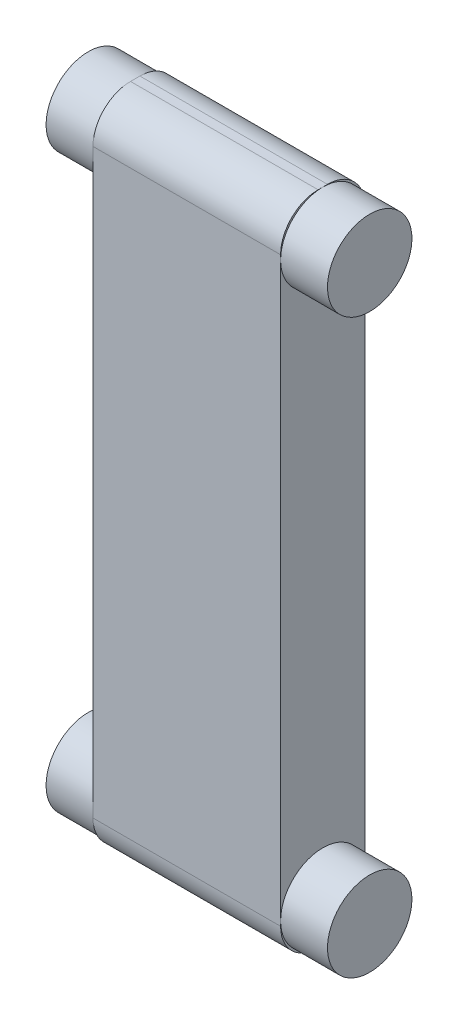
from build123d import *

# Parameters (mm, degrees)
BOSS_EXTRUDE1_DEPTH     = 45
SKETCH2_R               = 32.5
SKETCH2_R_2             = 22.5
CUT_EXTRUDE_THIN1_DEPTH = 25
CUT_EXTRUDE_THIN2_START = -25
SKETCH5_R               = 42.5
SKETCH5_R_2             = 22.5
CUT_EXTRUDE_THIN2_DEPTH = 25
SKETCH6_R               = 42.5
SKETCH6_R_2             = 22.5
CUT_EXTRUDE_THIN3_DEPTH = 25
CUT_EXTRUDE_THIN4_START = -25
SKETCH7_R               = 42.5
SKETCH7_R_2             = 22.5
CUT_EXTRUDE_THIN4_DEPTH = 25
FILLET3_R               = 20


with BuildPart() as part:
    # Sketch1 → Boss-Extrude1 (new body)
    with BuildSketch(Plane.XY):
        Polygon((-75, 0), (75, 0), (75, 45), (50, 45), (50, 305), (75, 305), (75, 350), (-75, 350), (-75, 305), (-50, 305), (-50, 45), (-75, 45), align=None)
    extrude(amount=BOSS_EXTRUDE1_DEPTH)

    # Sketch2 → Cut-Extrude-Thin1 (cut)
    with BuildSketch(Plane(origin=(75, 0, 0), x_dir=(0, 0, -1), z_dir=(1, 0, 0))):
        with Locations((-22.5, 327.5)):
            Circle(SKETCH2_R)
        with Locations((-22.5, 327.5)):
            Circle(SKETCH2_R_2, mode=Mode.SUBTRACT)
    extrude(amount=-CUT_EXTRUDE_THIN1_DEPTH, mode=Mode.SUBTRACT)

    # Sketch5 → Cut-Extrude-Thin2 (cut)
    with BuildSketch(Plane.ZY.offset(75).offset(CUT_EXTRUDE_THIN2_START)):
        with Locations((22.5, 327.5)):
            Circle(SKETCH5_R)
        with Locations((22.5, 327.5)):
            Circle(SKETCH5_R_2, mode=Mode.SUBTRACT)
    extrude(amount=CUT_EXTRUDE_THIN2_DEPTH, mode=Mode.SUBTRACT)

    # Sketch6 → Cut-Extrude-Thin3 (cut)
    with BuildSketch(Plane(origin=(75, 0, 0), x_dir=(0, 0, -1), z_dir=(1, 0, 0))):
        with Locations((-22.5, 22.5)):
            Circle(SKETCH6_R)
        with Locations((-22.5, 22.5)):
            Circle(SKETCH6_R_2, mode=Mode.SUBTRACT)
    extrude(amount=-CUT_EXTRUDE_THIN3_DEPTH, mode=Mode.SUBTRACT)

    # Sketch7 → Cut-Extrude-Thin4 (cut)
    with BuildSketch(Plane.ZY.offset(75).offset(CUT_EXTRUDE_THIN4_START)):
        with Locations((22.5, 22.5)):
            Circle(SKETCH7_R)
        with Locations((22.5, 22.5)):
            Circle(SKETCH7_R_2, mode=Mode.SUBTRACT)
    extrude(amount=CUT_EXTRUDE_THIN4_DEPTH, mode=Mode.SUBTRACT)

    # Fillet3
    fillet3_edges = [part.edges().sort_by_distance(p)[0] for p in [
        (0, 0, 0),
        (0, 0, 45),
        (0, 350, 0),
        (0, 350, 45),
    ]]
    fillet(fillet3_edges, radius=FILLET3_R)


solid = part.part
